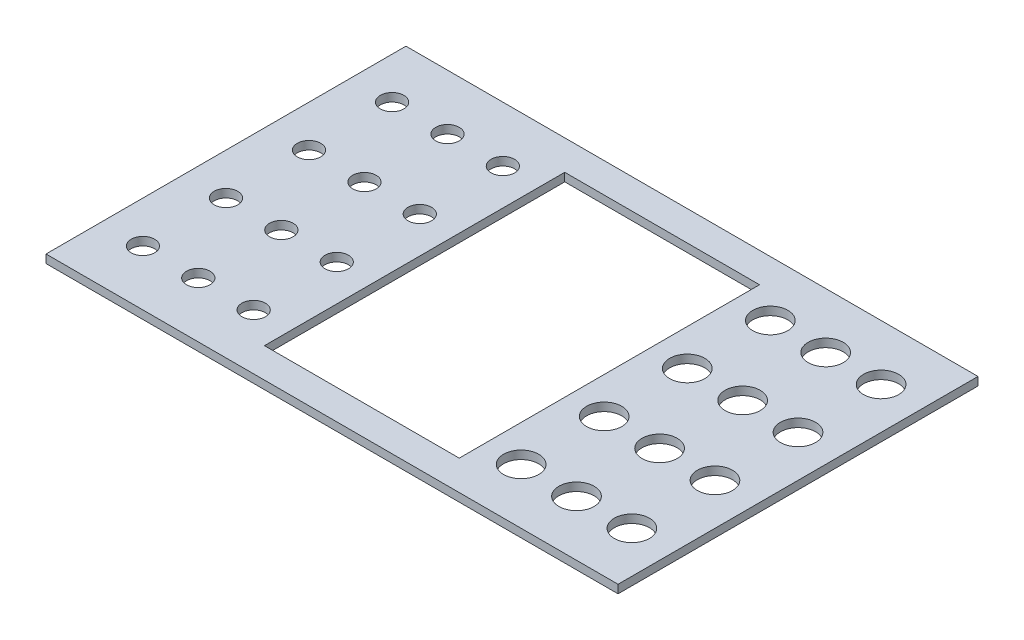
ISO-10303-21;
HEADER;
FILE_DESCRIPTION(('STEP AP214'),'2;1');
FILE_NAME('part.step','',(''),(''),'','','');
FILE_SCHEMA(('AUTOMOTIVE_DESIGN { 1 0 10303 214 1 1 1 1 }'));
ENDSEC;
DATA;
#1=APPLICATION_CONTEXT('core data for automotive mechanical design processes');
#2=APPLICATION_PROTOCOL_DEFINITION('international standard','automotive_design',2000,#1);
#3=PRODUCT_CONTEXT('',#1,'mechanical');
#4=PRODUCT('Part','Part','',(#3));
#5=PRODUCT_RELATED_PRODUCT_CATEGORY('part','',(#4));
#6=PRODUCT_DEFINITION_FORMATION('','',#4);
#7=PRODUCT_DEFINITION_CONTEXT('part definition',#1,'design');
#8=PRODUCT_DEFINITION('design','',#6,#7);
#9=PRODUCT_DEFINITION_SHAPE('','',#8);
#10=(LENGTH_UNIT() NAMED_UNIT(*) SI_UNIT(.MILLI.,.METRE.));
#11=(NAMED_UNIT(*) PLANE_ANGLE_UNIT() SI_UNIT($,.RADIAN.));
#12=(NAMED_UNIT(*) SI_UNIT($,.STERADIAN.) SOLID_ANGLE_UNIT());
#13=UNCERTAINTY_MEASURE_WITH_UNIT(LENGTH_MEASURE(1.E-05),#10,'distance_accuracy_value','');
#14=(GEOMETRIC_REPRESENTATION_CONTEXT(3) GLOBAL_UNCERTAINTY_ASSIGNED_CONTEXT((#13)) GLOBAL_UNIT_ASSIGNED_CONTEXT((#10,
#11,#12)) REPRESENTATION_CONTEXT('',''));
#15=CARTESIAN_POINT('',(0.,0.,0.));
#16=DIRECTION('',(0.,0.,1.));
#17=DIRECTION('',(1.,0.,0.));
#18=AXIS2_PLACEMENT_3D('',#15,#16,#17);
#19=CARTESIAN_POINT('',(206.6,6.,130.));
#20=DIRECTION('',(-1.,0.,0.));
#21=DIRECTION('',(0.,0.,1.));
#22=AXIS2_PLACEMENT_3D('',#19,#20,#21);
#23=PLANE('',#22);
#24=DIRECTION('',(0.,0.,-1.));
#25=VECTOR('',#24,1.);
#26=CARTESIAN_POINT('',(206.6,0.,130.));
#27=LINE('',#26,#25);
#28=CARTESIAN_POINT('',(206.6,0.,130.));
#29=VERTEX_POINT('',#28);
#30=CARTESIAN_POINT('',(206.6,0.,-130.));
#31=VERTEX_POINT('',#30);
#32=EDGE_CURVE('E223',#29,#31,#27,.T.);
#33=ORIENTED_EDGE('',*,*,#32,.T.);
#34=DIRECTION('',(0.,-1.,0.));
#35=VECTOR('',#34,1.);
#36=CARTESIAN_POINT('',(206.6,6.,-130.));
#37=LINE('',#36,#35);
#38=CARTESIAN_POINT('',(206.6,6.,-130.));
#39=VERTEX_POINT('',#38);
#40=EDGE_CURVE('E240',#39,#31,#37,.T.);
#41=ORIENTED_EDGE('',*,*,#40,.F.);
#42=DIRECTION('',(0.,0.,-1.));
#43=VECTOR('',#42,1.);
#44=CARTESIAN_POINT('',(206.6,6.,130.));
#45=LINE('',#44,#43);
#46=CARTESIAN_POINT('',(206.6,6.,130.));
#47=VERTEX_POINT('',#46);
#48=EDGE_CURVE('E212',#47,#39,#45,.T.);
#49=ORIENTED_EDGE('',*,*,#48,.F.);
#50=DIRECTION('',(0.,-1.,0.));
#51=VECTOR('',#50,1.);
#52=CARTESIAN_POINT('',(206.6,6.,130.));
#53=LINE('',#52,#51);
#54=EDGE_CURVE('E222',#47,#29,#53,.T.);
#55=ORIENTED_EDGE('',*,*,#54,.T.);
#56=EDGE_LOOP('',(#33,#41,#49,#55));
#57=FACE_BOUND('',#56,.T.);
#58=ADVANCED_FACE('F48',(#57),#23,.F.);
#59=CARTESIAN_POINT('',(-206.6,6.,-130.));
#60=DIRECTION('',(0.,0.,1.));
#61=DIRECTION('',(1.,0.,0.));
#62=AXIS2_PLACEMENT_3D('',#59,#60,#61);
#63=PLANE('',#62);
#64=DIRECTION('',(-1.,0.,0.));
#65=VECTOR('',#64,1.);
#66=CARTESIAN_POINT('',(-206.6,0.,-130.));
#67=LINE('',#66,#65);
#68=CARTESIAN_POINT('',(-206.6,0.,-130.));
#69=VERTEX_POINT('',#68);
#70=EDGE_CURVE('E226',#31,#69,#67,.T.);
#71=ORIENTED_EDGE('',*,*,#70,.T.);
#72=DIRECTION('',(0.,-1.,0.));
#73=VECTOR('',#72,1.);
#74=CARTESIAN_POINT('',(-206.6,6.,-130.));
#75=LINE('',#74,#73);
#76=CARTESIAN_POINT('',(-206.6,6.,-130.));
#77=VERTEX_POINT('',#76);
#78=EDGE_CURVE('E237',#77,#69,#75,.T.);
#79=ORIENTED_EDGE('',*,*,#78,.F.);
#80=DIRECTION('',(-1.,0.,0.));
#81=VECTOR('',#80,1.);
#82=CARTESIAN_POINT('',(-206.6,6.,-130.));
#83=LINE('',#82,#81);
#84=EDGE_CURVE('E215',#39,#77,#83,.T.);
#85=ORIENTED_EDGE('',*,*,#84,.F.);
#86=ORIENTED_EDGE('',*,*,#40,.T.);
#87=EDGE_LOOP('',(#71,#79,#85,#86));
#88=FACE_BOUND('',#87,.T.);
#89=ADVANCED_FACE('F338',(#88),#63,.F.);
#90=CARTESIAN_POINT('',(-206.6,6.,130.));
#91=DIRECTION('',(1.,0.,0.));
#92=DIRECTION('',(0.,0.,-1.));
#93=AXIS2_PLACEMENT_3D('',#90,#91,#92);
#94=PLANE('',#93);
#95=DIRECTION('',(0.,0.,1.));
#96=VECTOR('',#95,1.);
#97=CARTESIAN_POINT('',(-206.6,0.,130.));
#98=LINE('',#97,#96);
#99=CARTESIAN_POINT('',(-206.6,0.,130.));
#100=VERTEX_POINT('',#99);
#101=EDGE_CURVE('E229',#69,#100,#98,.T.);
#102=ORIENTED_EDGE('',*,*,#101,.T.);
#103=DIRECTION('',(0.,-1.,0.));
#104=VECTOR('',#103,1.);
#105=CARTESIAN_POINT('',(-206.6,6.,130.));
#106=LINE('',#105,#104);
#107=CARTESIAN_POINT('',(-206.6,6.,130.));
#108=VERTEX_POINT('',#107);
#109=EDGE_CURVE('E234',#108,#100,#106,.T.);
#110=ORIENTED_EDGE('',*,*,#109,.F.);
#111=DIRECTION('',(0.,0.,1.));
#112=VECTOR('',#111,1.);
#113=CARTESIAN_POINT('',(-206.6,6.,130.));
#114=LINE('',#113,#112);
#115=EDGE_CURVE('E218',#77,#108,#114,.T.);
#116=ORIENTED_EDGE('',*,*,#115,.F.);
#117=ORIENTED_EDGE('',*,*,#78,.T.);
#118=EDGE_LOOP('',(#102,#110,#116,#117));
#119=FACE_BOUND('',#118,.T.);
#120=ADVANCED_FACE('F343',(#119),#94,.F.);
#121=CARTESIAN_POINT('',(-206.6,6.,130.));
#122=DIRECTION('',(0.,0.,-1.));
#123=DIRECTION('',(-1.,0.,0.));
#124=AXIS2_PLACEMENT_3D('',#121,#122,#123);
#125=PLANE('',#124);
#126=DIRECTION('',(1.,0.,0.));
#127=VECTOR('',#126,1.);
#128=CARTESIAN_POINT('',(-206.6,0.,130.));
#129=LINE('',#128,#127);
#130=EDGE_CURVE('E216',#100,#29,#129,.T.);
#131=ORIENTED_EDGE('',*,*,#130,.T.);
#132=ORIENTED_EDGE('',*,*,#54,.F.);
#133=DIRECTION('',(1.,0.,0.));
#134=VECTOR('',#133,1.);
#135=CARTESIAN_POINT('',(-206.6,6.,130.));
#136=LINE('',#135,#134);
#137=EDGE_CURVE('E220',#108,#47,#136,.T.);
#138=ORIENTED_EDGE('',*,*,#137,.F.);
#139=ORIENTED_EDGE('',*,*,#109,.T.);
#140=EDGE_LOOP('',(#131,#132,#138,#139));
#141=FACE_BOUND('',#140,.T.);
#142=ADVANCED_FACE('F358',(#141),#125,.F.);
#143=CARTESIAN_POINT('',(0.,6.,0.));
#144=DIRECTION('',(0.,-1.,0.));
#145=DIRECTION('',(0.,0.,-1.));
#146=AXIS2_PLACEMENT_3D('',#143,#144,#145);
#147=PLANE('',#146);
#148=DIRECTION('',(-1.,0.,0.));
#149=VECTOR('',#148,1.);
#150=CARTESIAN_POINT('',(-70.35,6.,-108.45));
#151=LINE('',#150,#149);
#152=CARTESIAN_POINT('',(70.35,6.,-108.45));
#153=VERTEX_POINT('',#152);
#154=CARTESIAN_POINT('',(-70.35,6.,-108.45));
#155=VERTEX_POINT('',#154);
#156=EDGE_CURVE('E123',#153,#155,#151,.T.);
#157=ORIENTED_EDGE('',*,*,#156,.F.);
#158=DIRECTION('',(0.,0.,-1.));
#159=VECTOR('',#158,1.);
#160=CARTESIAN_POINT('',(70.35,6.,-108.45));
#161=LINE('',#160,#159);
#162=CARTESIAN_POINT('',(70.35,6.,108.45));
#163=VERTEX_POINT('',#162);
#164=EDGE_CURVE('E62',#163,#153,#161,.T.);
#165=ORIENTED_EDGE('',*,*,#164,.F.);
#166=DIRECTION('',(1.,0.,0.));
#167=VECTOR('',#166,1.);
#168=CARTESIAN_POINT('',(-70.35,6.,108.45));
#169=LINE('',#168,#167);
#170=CARTESIAN_POINT('',(-70.35,6.,108.45));
#171=VERTEX_POINT('',#170);
#172=EDGE_CURVE('E130',#171,#163,#169,.T.);
#173=ORIENTED_EDGE('',*,*,#172,.F.);
#174=DIRECTION('',(0.,0.,1.));
#175=VECTOR('',#174,1.);
#176=CARTESIAN_POINT('',(-70.35,6.,-108.45));
#177=LINE('',#176,#175);
#178=EDGE_CURVE('E114',#155,#171,#177,.T.);
#179=ORIENTED_EDGE('',*,*,#178,.F.);
#180=EDGE_LOOP('',(#157,#165,#173,#179));
#181=FACE_BOUND('',#180,.T.);
#182=CARTESIAN_POINT('',(176.6,6.,-90.));
#183=DIRECTION('',(0.,1.,0.));
#184=DIRECTION('',(0.,0.,1.));
#185=AXIS2_PLACEMENT_3D('',#182,#183,#184);
#186=CIRCLE('',#185,12.7);
#187=CARTESIAN_POINT('',(176.6,6.,-77.3));
#188=VERTEX_POINT('',#187);
#189=EDGE_CURVE('E164',#188,#188,#186,.T.);
#190=ORIENTED_EDGE('',*,*,#189,.F.);
#191=EDGE_LOOP('',(#190));
#192=FACE_BOUND('',#191,.T.);
#193=CARTESIAN_POINT('',(-176.6,6.,90.));
#194=DIRECTION('',(0.,1.,0.));
#195=DIRECTION('',(0.,0.,1.));
#196=AXIS2_PLACEMENT_3D('',#193,#194,#195);
#197=CIRCLE('',#196,8.50000000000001);
#198=CARTESIAN_POINT('',(-176.6,6.,98.5));
#199=VERTEX_POINT('',#198);
#200=EDGE_CURVE('E173',#199,#199,#197,.T.);
#201=ORIENTED_EDGE('',*,*,#200,.F.);
#202=EDGE_LOOP('',(#201));
#203=FACE_BOUND('',#202,.T.);
#204=CARTESIAN_POINT('',(-176.6,6.,30.));
#205=DIRECTION('',(0.,1.,0.));
#206=DIRECTION('',(0.,0.,1.));
#207=AXIS2_PLACEMENT_3D('',#204,#205,#206);
#208=CIRCLE('',#207,8.50000000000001);
#209=CARTESIAN_POINT('',(-176.6,6.,38.5));
#210=VERTEX_POINT('',#209);
#211=EDGE_CURVE('E176',#210,#210,#208,.T.);
#212=ORIENTED_EDGE('',*,*,#211,.F.);
#213=EDGE_LOOP('',(#212));
#214=FACE_BOUND('',#213,.T.);
#215=CARTESIAN_POINT('',(-176.6,6.,-30.));
#216=DIRECTION('',(0.,1.,0.));
#217=DIRECTION('',(0.,0.,1.));
#218=AXIS2_PLACEMENT_3D('',#215,#216,#217);
#219=CIRCLE('',#218,8.50000000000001);
#220=CARTESIAN_POINT('',(-176.6,6.,-21.5));
#221=VERTEX_POINT('',#220);
#222=EDGE_CURVE('E179',#221,#221,#219,.T.);
#223=ORIENTED_EDGE('',*,*,#222,.F.);
#224=EDGE_LOOP('',(#223));
#225=FACE_BOUND('',#224,.T.);
#226=CARTESIAN_POINT('',(136.6,6.,-89.9999999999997));
#227=DIRECTION('',(0.,1.,0.));
#228=DIRECTION('',(0.,0.,1.));
#229=AXIS2_PLACEMENT_3D('',#226,#227,#228);
#230=CIRCLE('',#229,12.7);
#231=CARTESIAN_POINT('',(136.6,6.,-77.2999999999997));
#232=VERTEX_POINT('',#231);
#233=EDGE_CURVE('E161',#232,#232,#230,.T.);
#234=ORIENTED_EDGE('',*,*,#233,.F.);
#235=EDGE_LOOP('',(#234));
#236=FACE_BOUND('',#235,.T.);
#237=CARTESIAN_POINT('',(136.600000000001,6.,-29.9999999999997));
#238=DIRECTION('',(0.,1.,0.));
#239=DIRECTION('',(0.,0.,1.));
#240=AXIS2_PLACEMENT_3D('',#237,#238,#239);
#241=CIRCLE('',#240,12.7);
#242=CARTESIAN_POINT('',(136.600000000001,6.,-17.2999999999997));
#243=VERTEX_POINT('',#242);
#244=EDGE_CURVE('E165',#243,#243,#241,.T.);
#245=ORIENTED_EDGE('',*,*,#244,.F.);
#246=EDGE_LOOP('',(#245));
#247=FACE_BOUND('',#246,.T.);
#248=CARTESIAN_POINT('',(136.600000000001,6.,30.0000000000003));
#249=DIRECTION('',(0.,1.,0.));
#250=DIRECTION('',(0.,0.,1.));
#251=AXIS2_PLACEMENT_3D('',#248,#249,#250);
#252=CIRCLE('',#251,12.7);
#253=CARTESIAN_POINT('',(136.600000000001,6.,42.7000000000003));
#254=VERTEX_POINT('',#253);
#255=EDGE_CURVE('E168',#254,#254,#252,.T.);
#256=ORIENTED_EDGE('',*,*,#255,.F.);
#257=EDGE_LOOP('',(#256));
#258=FACE_BOUND('',#257,.T.);
#259=CARTESIAN_POINT('',(136.600000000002,6.,90.0000000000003));
#260=DIRECTION('',(0.,1.,0.));
#261=DIRECTION('',(0.,0.,1.));
#262=AXIS2_PLACEMENT_3D('',#259,#260,#261);
#263=CIRCLE('',#262,12.7);
#264=CARTESIAN_POINT('',(136.600000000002,6.,102.7));
#265=VERTEX_POINT('',#264);
#266=EDGE_CURVE('E158',#265,#265,#263,.T.);
#267=ORIENTED_EDGE('',*,*,#266,.F.);
#268=EDGE_LOOP('',(#267));
#269=FACE_BOUND('',#268,.T.);
#270=CARTESIAN_POINT('',(-96.6000000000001,6.,90.));
#271=DIRECTION('',(0.,1.,0.));
#272=DIRECTION('',(0.,0.,1.));
#273=AXIS2_PLACEMENT_3D('',#270,#271,#272);
#274=CIRCLE('',#273,8.50000000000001);
#275=CARTESIAN_POINT('',(-96.6000000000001,6.,98.5));
#276=VERTEX_POINT('',#275);
#277=EDGE_CURVE('E182',#276,#276,#274,.T.);
#278=ORIENTED_EDGE('',*,*,#277,.F.);
#279=EDGE_LOOP('',(#278));
#280=FACE_BOUND('',#279,.T.);
#281=CARTESIAN_POINT('',(-136.6,6.,90.));
#282=DIRECTION('',(0.,1.,0.));
#283=DIRECTION('',(0.,0.,1.));
#284=AXIS2_PLACEMENT_3D('',#281,#282,#283);
#285=CIRCLE('',#284,8.50000000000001);
#286=CARTESIAN_POINT('',(-136.6,6.,98.5));
#287=VERTEX_POINT('',#286);
#288=EDGE_CURVE('E204',#287,#287,#285,.T.);
#289=ORIENTED_EDGE('',*,*,#288,.F.);
#290=EDGE_LOOP('',(#289));
#291=FACE_BOUND('',#290,.T.);
#292=CARTESIAN_POINT('',(-96.6000000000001,6.,30.));
#293=DIRECTION('',(0.,1.,0.));
#294=DIRECTION('',(0.,0.,1.));
#295=AXIS2_PLACEMENT_3D('',#292,#293,#294);
#296=CIRCLE('',#295,8.5);
#297=CARTESIAN_POINT('',(-96.6000000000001,6.,38.5));
#298=VERTEX_POINT('',#297);
#299=EDGE_CURVE('E201',#298,#298,#296,.T.);
#300=ORIENTED_EDGE('',*,*,#299,.F.);
#301=EDGE_LOOP('',(#300));
#302=FACE_BOUND('',#301,.T.);
#303=CARTESIAN_POINT('',(-136.6,6.,30.));
#304=DIRECTION('',(0.,1.,0.));
#305=DIRECTION('',(0.,0.,1.));
#306=AXIS2_PLACEMENT_3D('',#303,#304,#305);
#307=CIRCLE('',#306,8.50000000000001);
#308=CARTESIAN_POINT('',(-136.6,6.,38.5));
#309=VERTEX_POINT('',#308);
#310=EDGE_CURVE('E198',#309,#309,#307,.T.);
#311=ORIENTED_EDGE('',*,*,#310,.F.);
#312=EDGE_LOOP('',(#311));
#313=FACE_BOUND('',#312,.T.);
#314=CARTESIAN_POINT('',(-96.6000000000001,6.,-30.));
#315=DIRECTION('',(0.,1.,0.));
#316=DIRECTION('',(0.,0.,1.));
#317=AXIS2_PLACEMENT_3D('',#314,#315,#316);
#318=CIRCLE('',#317,8.5);
#319=CARTESIAN_POINT('',(-96.6000000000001,6.,-21.5));
#320=VERTEX_POINT('',#319);
#321=EDGE_CURVE('E195',#320,#320,#318,.T.);
#322=ORIENTED_EDGE('',*,*,#321,.F.);
#323=EDGE_LOOP('',(#322));
#324=FACE_BOUND('',#323,.T.);
#325=CARTESIAN_POINT('',(-136.6,6.,-30.));
#326=DIRECTION('',(0.,1.,0.));
#327=DIRECTION('',(0.,0.,1.));
#328=AXIS2_PLACEMENT_3D('',#325,#326,#327);
#329=CIRCLE('',#328,8.50000000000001);
#330=CARTESIAN_POINT('',(-136.6,6.,-21.5));
#331=VERTEX_POINT('',#330);
#332=EDGE_CURVE('E192',#331,#331,#329,.T.);
#333=ORIENTED_EDGE('',*,*,#332,.F.);
#334=EDGE_LOOP('',(#333));
#335=FACE_BOUND('',#334,.T.);
#336=CARTESIAN_POINT('',(-96.6000000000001,6.,-90.));
#337=DIRECTION('',(0.,1.,0.));
#338=DIRECTION('',(0.,0.,1.));
#339=AXIS2_PLACEMENT_3D('',#336,#337,#338);
#340=CIRCLE('',#339,8.50000000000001);
#341=CARTESIAN_POINT('',(-96.6000000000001,6.,-81.5));
#342=VERTEX_POINT('',#341);
#343=EDGE_CURVE('E189',#342,#342,#340,.T.);
#344=ORIENTED_EDGE('',*,*,#343,.F.);
#345=EDGE_LOOP('',(#344));
#346=FACE_BOUND('',#345,.T.);
#347=CARTESIAN_POINT('',(-136.6,6.,-90.));
#348=DIRECTION('',(0.,1.,0.));
#349=DIRECTION('',(0.,0.,1.));
#350=AXIS2_PLACEMENT_3D('',#347,#348,#349);
#351=CIRCLE('',#350,8.50000000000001);
#352=CARTESIAN_POINT('',(-136.6,6.,-81.5));
#353=VERTEX_POINT('',#352);
#354=EDGE_CURVE('E185',#353,#353,#351,.T.);
#355=ORIENTED_EDGE('',*,*,#354,.F.);
#356=EDGE_LOOP('',(#355));
#357=FACE_BOUND('',#356,.T.);
#358=CARTESIAN_POINT('',(96.6000000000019,6.,90.0000000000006));
#359=DIRECTION('',(0.,1.,0.));
#360=DIRECTION('',(0.,0.,1.));
#361=AXIS2_PLACEMENT_3D('',#358,#359,#360);
#362=CIRCLE('',#361,12.7);
#363=CARTESIAN_POINT('',(96.6000000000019,6.,102.700000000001));
#364=VERTEX_POINT('',#363);
#365=EDGE_CURVE('E137',#364,#364,#362,.T.);
#366=ORIENTED_EDGE('',*,*,#365,.F.);
#367=EDGE_LOOP('',(#366));
#368=FACE_BOUND('',#367,.T.);
#369=CARTESIAN_POINT('',(96.6000000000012,6.,30.0000000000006));
#370=DIRECTION('',(0.,1.,0.));
#371=DIRECTION('',(0.,0.,1.));
#372=AXIS2_PLACEMENT_3D('',#369,#370,#371);
#373=CIRCLE('',#372,12.7);
#374=CARTESIAN_POINT('',(96.6000000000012,6.,42.7000000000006));
#375=VERTEX_POINT('',#374);
#376=EDGE_CURVE('E144',#375,#375,#373,.T.);
#377=ORIENTED_EDGE('',*,*,#376,.F.);
#378=EDGE_LOOP('',(#377));
#379=FACE_BOUND('',#378,.T.);
#380=CARTESIAN_POINT('',(96.6000000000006,6.,-29.9999999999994));
#381=DIRECTION('',(0.,1.,0.));
#382=DIRECTION('',(0.,0.,1.));
#383=AXIS2_PLACEMENT_3D('',#380,#381,#382);
#384=CIRCLE('',#383,12.7);
#385=CARTESIAN_POINT('',(96.6000000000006,6.,-17.2999999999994));
#386=VERTEX_POINT('',#385);
#387=EDGE_CURVE('E140',#386,#386,#384,.T.);
#388=ORIENTED_EDGE('',*,*,#387,.F.);
#389=EDGE_LOOP('',(#388));
#390=FACE_BOUND('',#389,.T.);
#391=CARTESIAN_POINT('',(176.600000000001,6.,-30.));
#392=DIRECTION('',(0.,1.,0.));
#393=DIRECTION('',(0.,0.,1.));
#394=AXIS2_PLACEMENT_3D('',#391,#392,#393);
#395=CIRCLE('',#394,12.7);
#396=CARTESIAN_POINT('',(176.600000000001,6.,-17.3));
#397=VERTEX_POINT('',#396);
#398=EDGE_CURVE('E155',#397,#397,#395,.T.);
#399=ORIENTED_EDGE('',*,*,#398,.F.);
#400=EDGE_LOOP('',(#399));
#401=FACE_BOUND('',#400,.T.);
#402=CARTESIAN_POINT('',(176.600000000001,6.,30.));
#403=DIRECTION('',(0.,1.,0.));
#404=DIRECTION('',(0.,0.,1.));
#405=AXIS2_PLACEMENT_3D('',#402,#403,#404);
#406=CIRCLE('',#405,12.7);
#407=CARTESIAN_POINT('',(176.600000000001,6.,42.7));
#408=VERTEX_POINT('',#407);
#409=EDGE_CURVE('E152',#408,#408,#406,.T.);
#410=ORIENTED_EDGE('',*,*,#409,.F.);
#411=EDGE_LOOP('',(#410));
#412=FACE_BOUND('',#411,.T.);
#413=CARTESIAN_POINT('',(176.6,6.,90.));
#414=DIRECTION('',(0.,1.,0.));
#415=DIRECTION('',(0.,0.,1.));
#416=AXIS2_PLACEMENT_3D('',#413,#414,#415);
#417=CIRCLE('',#416,12.7);
#418=CARTESIAN_POINT('',(176.6,6.,102.7));
#419=VERTEX_POINT('',#418);
#420=EDGE_CURVE('E149',#419,#419,#417,.T.);
#421=ORIENTED_EDGE('',*,*,#420,.F.);
#422=EDGE_LOOP('',(#421));
#423=FACE_BOUND('',#422,.T.);
#424=CARTESIAN_POINT('',(96.6,6.,-89.9999999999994));
#425=DIRECTION('',(0.,1.,0.));
#426=DIRECTION('',(0.,0.,1.));
#427=AXIS2_PLACEMENT_3D('',#424,#425,#426);
#428=CIRCLE('',#427,12.7);
#429=CARTESIAN_POINT('',(96.6,6.,-77.2999999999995));
#430=VERTEX_POINT('',#429);
#431=EDGE_CURVE('E143',#430,#430,#428,.T.);
#432=ORIENTED_EDGE('',*,*,#431,.F.);
#433=EDGE_LOOP('',(#432));
#434=FACE_BOUND('',#433,.T.);
#435=CARTESIAN_POINT('',(-176.6,6.,-90.));
#436=DIRECTION('',(0.,1.,0.));
#437=DIRECTION('',(0.,0.,1.));
#438=AXIS2_PLACEMENT_3D('',#435,#436,#437);
#439=CIRCLE('',#438,8.50000000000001);
#440=CARTESIAN_POINT('',(-176.6,6.,-81.5));
#441=VERTEX_POINT('',#440);
#442=EDGE_CURVE('E188',#441,#441,#439,.T.);
#443=ORIENTED_EDGE('',*,*,#442,.F.);
#444=EDGE_LOOP('',(#443));
#445=FACE_BOUND('',#444,.T.);
#446=ORIENTED_EDGE('',*,*,#48,.T.);
#447=ORIENTED_EDGE('',*,*,#84,.T.);
#448=ORIENTED_EDGE('',*,*,#115,.T.);
#449=ORIENTED_EDGE('',*,*,#137,.T.);
#450=EDGE_LOOP('',(#446,#447,#448,#449));
#451=FACE_BOUND('',#450,.T.);
#452=ADVANCED_FACE('F127',(#181,#192,#203,#214,#225,#236,#247,#258,#269,#280,#291,#302,#313,
#324,#335,#346,#357,#368,#379,#390,#401,#412,#423,#434,#445,#451),#147,.F.);
#453=CARTESIAN_POINT('',(0.,0.,0.));
#454=DIRECTION('',(0.,-1.,0.));
#455=DIRECTION('',(0.,0.,-1.));
#456=AXIS2_PLACEMENT_3D('',#453,#454,#455);
#457=PLANE('',#456);
#458=DIRECTION('',(0.,0.,1.));
#459=VECTOR('',#458,1.);
#460=CARTESIAN_POINT('',(70.35,0.,0.));
#461=LINE('',#460,#459);
#462=CARTESIAN_POINT('',(70.35,0.,-108.45));
#463=VERTEX_POINT('',#462);
#464=CARTESIAN_POINT('',(70.35,0.,108.45));
#465=VERTEX_POINT('',#464);
#466=EDGE_CURVE('E13',#463,#465,#461,.T.);
#467=ORIENTED_EDGE('',*,*,#466,.F.);
#468=DIRECTION('',(1.,0.,0.));
#469=VECTOR('',#468,1.);
#470=CARTESIAN_POINT('',(0.,0.,-108.45));
#471=LINE('',#470,#469);
#472=CARTESIAN_POINT('',(-70.35,0.,-108.45));
#473=VERTEX_POINT('',#472);
#474=EDGE_CURVE('E243',#473,#463,#471,.T.);
#475=ORIENTED_EDGE('',*,*,#474,.F.);
#476=DIRECTION('',(0.,0.,-1.));
#477=VECTOR('',#476,1.);
#478=CARTESIAN_POINT('',(-70.35,0.,0.));
#479=LINE('',#478,#477);
#480=CARTESIAN_POINT('',(-70.35,0.,108.45));
#481=VERTEX_POINT('',#480);
#482=EDGE_CURVE('E117',#481,#473,#479,.T.);
#483=ORIENTED_EDGE('',*,*,#482,.F.);
#484=DIRECTION('',(-1.,0.,0.));
#485=VECTOR('',#484,1.);
#486=CARTESIAN_POINT('',(0.,0.,108.45));
#487=LINE('',#486,#485);
#488=EDGE_CURVE('E55',#465,#481,#487,.T.);
#489=ORIENTED_EDGE('',*,*,#488,.F.);
#490=EDGE_LOOP('',(#467,#475,#483,#489));
#491=FACE_BOUND('',#490,.T.);
#492=CARTESIAN_POINT('',(176.6,0.,-90.));
#493=DIRECTION('',(0.,-1.,0.));
#494=DIRECTION('',(0.,0.,-1.));
#495=AXIS2_PLACEMENT_3D('',#492,#493,#494);
#496=CIRCLE('',#495,12.7);
#497=CARTESIAN_POINT('',(176.6,0.,-102.7));
#498=VERTEX_POINT('',#497);
#499=EDGE_CURVE('E227',#498,#498,#496,.T.);
#500=ORIENTED_EDGE('',*,*,#499,.F.);
#501=EDGE_LOOP('',(#500));
#502=FACE_BOUND('',#501,.T.);
#503=CARTESIAN_POINT('',(-176.6,0.,90.));
#504=DIRECTION('',(0.,-1.,0.));
#505=DIRECTION('',(0.,0.,-1.));
#506=AXIS2_PLACEMENT_3D('',#503,#504,#505);
#507=CIRCLE('',#506,8.50000000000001);
#508=CARTESIAN_POINT('',(-176.6,0.,81.5));
#509=VERTEX_POINT('',#508);
#510=EDGE_CURVE('E309',#509,#509,#507,.T.);
#511=ORIENTED_EDGE('',*,*,#510,.F.);
#512=EDGE_LOOP('',(#511));
#513=FACE_BOUND('',#512,.T.);
#514=CARTESIAN_POINT('',(-176.6,0.,30.));
#515=DIRECTION('',(0.,-1.,0.));
#516=DIRECTION('',(0.,0.,-1.));
#517=AXIS2_PLACEMENT_3D('',#514,#515,#516);
#518=CIRCLE('',#517,8.50000000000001);
#519=CARTESIAN_POINT('',(-176.6,0.,21.5));
#520=VERTEX_POINT('',#519);
#521=EDGE_CURVE('E306',#520,#520,#518,.T.);
#522=ORIENTED_EDGE('',*,*,#521,.F.);
#523=EDGE_LOOP('',(#522));
#524=FACE_BOUND('',#523,.T.);
#525=CARTESIAN_POINT('',(-176.6,0.,-30.));
#526=DIRECTION('',(0.,-1.,0.));
#527=DIRECTION('',(0.,0.,-1.));
#528=AXIS2_PLACEMENT_3D('',#525,#526,#527);
#529=CIRCLE('',#528,8.50000000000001);
#530=CARTESIAN_POINT('',(-176.6,0.,-38.5));
#531=VERTEX_POINT('',#530);
#532=EDGE_CURVE('E303',#531,#531,#529,.T.);
#533=ORIENTED_EDGE('',*,*,#532,.F.);
#534=EDGE_LOOP('',(#533));
#535=FACE_BOUND('',#534,.T.);
#536=CARTESIAN_POINT('',(136.6,0.,-89.9999999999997));
#537=DIRECTION('',(0.,-1.,0.));
#538=DIRECTION('',(0.,0.,-1.));
#539=AXIS2_PLACEMENT_3D('',#536,#537,#538);
#540=CIRCLE('',#539,12.7);
#541=CARTESIAN_POINT('',(136.6,0.,-102.7));
#542=VERTEX_POINT('',#541);
#543=EDGE_CURVE('E300',#542,#542,#540,.T.);
#544=ORIENTED_EDGE('',*,*,#543,.F.);
#545=EDGE_LOOP('',(#544));
#546=FACE_BOUND('',#545,.T.);
#547=CARTESIAN_POINT('',(136.600000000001,0.,-29.9999999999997));
#548=DIRECTION('',(0.,-1.,0.));
#549=DIRECTION('',(0.,0.,-1.));
#550=AXIS2_PLACEMENT_3D('',#547,#548,#549);
#551=CIRCLE('',#550,12.7);
#552=CARTESIAN_POINT('',(136.600000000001,0.,-42.6999999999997));
#553=VERTEX_POINT('',#552);
#554=EDGE_CURVE('E297',#553,#553,#551,.T.);
#555=ORIENTED_EDGE('',*,*,#554,.F.);
#556=EDGE_LOOP('',(#555));
#557=FACE_BOUND('',#556,.T.);
#558=CARTESIAN_POINT('',(136.600000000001,0.,30.0000000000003));
#559=DIRECTION('',(0.,-1.,0.));
#560=DIRECTION('',(0.,0.,-1.));
#561=AXIS2_PLACEMENT_3D('',#558,#559,#560);
#562=CIRCLE('',#561,12.7);
#563=CARTESIAN_POINT('',(136.600000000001,0.,17.3000000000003));
#564=VERTEX_POINT('',#563);
#565=EDGE_CURVE('E294',#564,#564,#562,.T.);
#566=ORIENTED_EDGE('',*,*,#565,.F.);
#567=EDGE_LOOP('',(#566));
#568=FACE_BOUND('',#567,.T.);
#569=CARTESIAN_POINT('',(136.600000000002,0.,90.0000000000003));
#570=DIRECTION('',(0.,-1.,0.));
#571=DIRECTION('',(0.,0.,-1.));
#572=AXIS2_PLACEMENT_3D('',#569,#570,#571);
#573=CIRCLE('',#572,12.7);
#574=CARTESIAN_POINT('',(136.600000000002,0.,77.3000000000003));
#575=VERTEX_POINT('',#574);
#576=EDGE_CURVE('E291',#575,#575,#573,.T.);
#577=ORIENTED_EDGE('',*,*,#576,.F.);
#578=EDGE_LOOP('',(#577));
#579=FACE_BOUND('',#578,.T.);
#580=CARTESIAN_POINT('',(-96.6000000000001,0.,90.));
#581=DIRECTION('',(0.,-1.,0.));
#582=DIRECTION('',(0.,0.,-1.));
#583=AXIS2_PLACEMENT_3D('',#580,#581,#582);
#584=CIRCLE('',#583,8.50000000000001);
#585=CARTESIAN_POINT('',(-96.6000000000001,0.,81.5));
#586=VERTEX_POINT('',#585);
#587=EDGE_CURVE('E288',#586,#586,#584,.T.);
#588=ORIENTED_EDGE('',*,*,#587,.F.);
#589=EDGE_LOOP('',(#588));
#590=FACE_BOUND('',#589,.T.);
#591=CARTESIAN_POINT('',(-136.6,0.,90.));
#592=DIRECTION('',(0.,-1.,0.));
#593=DIRECTION('',(0.,0.,-1.));
#594=AXIS2_PLACEMENT_3D('',#591,#592,#593);
#595=CIRCLE('',#594,8.50000000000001);
#596=CARTESIAN_POINT('',(-136.6,0.,81.5));
#597=VERTEX_POINT('',#596);
#598=EDGE_CURVE('E285',#597,#597,#595,.T.);
#599=ORIENTED_EDGE('',*,*,#598,.F.);
#600=EDGE_LOOP('',(#599));
#601=FACE_BOUND('',#600,.T.);
#602=CARTESIAN_POINT('',(-96.6000000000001,0.,30.));
#603=DIRECTION('',(0.,-1.,0.));
#604=DIRECTION('',(0.,0.,-1.));
#605=AXIS2_PLACEMENT_3D('',#602,#603,#604);
#606=CIRCLE('',#605,8.5);
#607=CARTESIAN_POINT('',(-96.6000000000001,0.,21.5));
#608=VERTEX_POINT('',#607);
#609=EDGE_CURVE('E282',#608,#608,#606,.T.);
#610=ORIENTED_EDGE('',*,*,#609,.F.);
#611=EDGE_LOOP('',(#610));
#612=FACE_BOUND('',#611,.T.);
#613=CARTESIAN_POINT('',(-136.6,0.,30.));
#614=DIRECTION('',(0.,-1.,0.));
#615=DIRECTION('',(0.,0.,-1.));
#616=AXIS2_PLACEMENT_3D('',#613,#614,#615);
#617=CIRCLE('',#616,8.50000000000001);
#618=CARTESIAN_POINT('',(-136.6,0.,21.5));
#619=VERTEX_POINT('',#618);
#620=EDGE_CURVE('E279',#619,#619,#617,.T.);
#621=ORIENTED_EDGE('',*,*,#620,.F.);
#622=EDGE_LOOP('',(#621));
#623=FACE_BOUND('',#622,.T.);
#624=CARTESIAN_POINT('',(-96.6000000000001,0.,-30.));
#625=DIRECTION('',(0.,-1.,0.));
#626=DIRECTION('',(0.,0.,-1.));
#627=AXIS2_PLACEMENT_3D('',#624,#625,#626);
#628=CIRCLE('',#627,8.5);
#629=CARTESIAN_POINT('',(-96.6000000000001,0.,-38.5));
#630=VERTEX_POINT('',#629);
#631=EDGE_CURVE('E276',#630,#630,#628,.T.);
#632=ORIENTED_EDGE('',*,*,#631,.F.);
#633=EDGE_LOOP('',(#632));
#634=FACE_BOUND('',#633,.T.);
#635=CARTESIAN_POINT('',(-136.6,0.,-30.));
#636=DIRECTION('',(0.,-1.,0.));
#637=DIRECTION('',(0.,0.,-1.));
#638=AXIS2_PLACEMENT_3D('',#635,#636,#637);
#639=CIRCLE('',#638,8.50000000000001);
#640=CARTESIAN_POINT('',(-136.6,0.,-38.5));
#641=VERTEX_POINT('',#640);
#642=EDGE_CURVE('E273',#641,#641,#639,.T.);
#643=ORIENTED_EDGE('',*,*,#642,.F.);
#644=EDGE_LOOP('',(#643));
#645=FACE_BOUND('',#644,.T.);
#646=CARTESIAN_POINT('',(-96.6000000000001,0.,-90.));
#647=DIRECTION('',(0.,-1.,0.));
#648=DIRECTION('',(0.,0.,-1.));
#649=AXIS2_PLACEMENT_3D('',#646,#647,#648);
#650=CIRCLE('',#649,8.50000000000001);
#651=CARTESIAN_POINT('',(-96.6000000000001,0.,-98.5));
#652=VERTEX_POINT('',#651);
#653=EDGE_CURVE('E270',#652,#652,#650,.T.);
#654=ORIENTED_EDGE('',*,*,#653,.F.);
#655=EDGE_LOOP('',(#654));
#656=FACE_BOUND('',#655,.T.);
#657=CARTESIAN_POINT('',(-136.6,0.,-90.));
#658=DIRECTION('',(0.,-1.,0.));
#659=DIRECTION('',(0.,0.,-1.));
#660=AXIS2_PLACEMENT_3D('',#657,#658,#659);
#661=CIRCLE('',#660,8.50000000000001);
#662=CARTESIAN_POINT('',(-136.6,0.,-98.5));
#663=VERTEX_POINT('',#662);
#664=EDGE_CURVE('E267',#663,#663,#661,.T.);
#665=ORIENTED_EDGE('',*,*,#664,.F.);
#666=EDGE_LOOP('',(#665));
#667=FACE_BOUND('',#666,.T.);
#668=CARTESIAN_POINT('',(96.6000000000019,0.,90.0000000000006));
#669=DIRECTION('',(0.,-1.,0.));
#670=DIRECTION('',(0.,0.,-1.));
#671=AXIS2_PLACEMENT_3D('',#668,#669,#670);
#672=CIRCLE('',#671,12.7);
#673=CARTESIAN_POINT('',(96.6000000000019,0.,77.3000000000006));
#674=VERTEX_POINT('',#673);
#675=EDGE_CURVE('E264',#674,#674,#672,.T.);
#676=ORIENTED_EDGE('',*,*,#675,.F.);
#677=EDGE_LOOP('',(#676));
#678=FACE_BOUND('',#677,.T.);
#679=CARTESIAN_POINT('',(96.6000000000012,0.,30.0000000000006));
#680=DIRECTION('',(0.,-1.,0.));
#681=DIRECTION('',(0.,0.,-1.));
#682=AXIS2_PLACEMENT_3D('',#679,#680,#681);
#683=CIRCLE('',#682,12.7);
#684=CARTESIAN_POINT('',(96.6000000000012,0.,17.3000000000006));
#685=VERTEX_POINT('',#684);
#686=EDGE_CURVE('E261',#685,#685,#683,.T.);
#687=ORIENTED_EDGE('',*,*,#686,.F.);
#688=EDGE_LOOP('',(#687));
#689=FACE_BOUND('',#688,.T.);
#690=CARTESIAN_POINT('',(96.6000000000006,0.,-29.9999999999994));
#691=DIRECTION('',(0.,-1.,0.));
#692=DIRECTION('',(0.,0.,-1.));
#693=AXIS2_PLACEMENT_3D('',#690,#691,#692);
#694=CIRCLE('',#693,12.7);
#695=CARTESIAN_POINT('',(96.6000000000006,0.,-42.6999999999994));
#696=VERTEX_POINT('',#695);
#697=EDGE_CURVE('E258',#696,#696,#694,.T.);
#698=ORIENTED_EDGE('',*,*,#697,.F.);
#699=EDGE_LOOP('',(#698));
#700=FACE_BOUND('',#699,.T.);
#701=CARTESIAN_POINT('',(176.600000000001,0.,-30.));
#702=DIRECTION('',(0.,-1.,0.));
#703=DIRECTION('',(0.,0.,-1.));
#704=AXIS2_PLACEMENT_3D('',#701,#702,#703);
#705=CIRCLE('',#704,12.7);
#706=CARTESIAN_POINT('',(176.600000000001,0.,-42.7));
#707=VERTEX_POINT('',#706);
#708=EDGE_CURVE('E255',#707,#707,#705,.T.);
#709=ORIENTED_EDGE('',*,*,#708,.F.);
#710=EDGE_LOOP('',(#709));
#711=FACE_BOUND('',#710,.T.);
#712=CARTESIAN_POINT('',(176.600000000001,0.,30.));
#713=DIRECTION('',(0.,-1.,0.));
#714=DIRECTION('',(0.,0.,-1.));
#715=AXIS2_PLACEMENT_3D('',#712,#713,#714);
#716=CIRCLE('',#715,12.7);
#717=CARTESIAN_POINT('',(176.600000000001,0.,17.3));
#718=VERTEX_POINT('',#717);
#719=EDGE_CURVE('E252',#718,#718,#716,.T.);
#720=ORIENTED_EDGE('',*,*,#719,.F.);
#721=EDGE_LOOP('',(#720));
#722=FACE_BOUND('',#721,.T.);
#723=CARTESIAN_POINT('',(176.6,0.,90.));
#724=DIRECTION('',(0.,-1.,0.));
#725=DIRECTION('',(0.,0.,-1.));
#726=AXIS2_PLACEMENT_3D('',#723,#724,#725);
#727=CIRCLE('',#726,12.7);
#728=CARTESIAN_POINT('',(176.6,0.,77.3));
#729=VERTEX_POINT('',#728);
#730=EDGE_CURVE('E249',#729,#729,#727,.T.);
#731=ORIENTED_EDGE('',*,*,#730,.F.);
#732=EDGE_LOOP('',(#731));
#733=FACE_BOUND('',#732,.T.);
#734=CARTESIAN_POINT('',(96.6,0.,-89.9999999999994));
#735=DIRECTION('',(0.,-1.,0.));
#736=DIRECTION('',(0.,0.,-1.));
#737=AXIS2_PLACEMENT_3D('',#734,#735,#736);
#738=CIRCLE('',#737,12.7);
#739=CARTESIAN_POINT('',(96.6,0.,-102.699999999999));
#740=VERTEX_POINT('',#739);
#741=EDGE_CURVE('E246',#740,#740,#738,.T.);
#742=ORIENTED_EDGE('',*,*,#741,.F.);
#743=EDGE_LOOP('',(#742));
#744=FACE_BOUND('',#743,.T.);
#745=CARTESIAN_POINT('',(-176.6,0.,-90.));
#746=DIRECTION('',(0.,-1.,0.));
#747=DIRECTION('',(0.,0.,-1.));
#748=AXIS2_PLACEMENT_3D('',#745,#746,#747);
#749=CIRCLE('',#748,8.50000000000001);
#750=CARTESIAN_POINT('',(-176.6,0.,-98.5));
#751=VERTEX_POINT('',#750);
#752=EDGE_CURVE('E211',#751,#751,#749,.T.);
#753=ORIENTED_EDGE('',*,*,#752,.F.);
#754=EDGE_LOOP('',(#753));
#755=FACE_BOUND('',#754,.T.);
#756=ORIENTED_EDGE('',*,*,#32,.F.);
#757=ORIENTED_EDGE('',*,*,#130,.F.);
#758=ORIENTED_EDGE('',*,*,#101,.F.);
#759=ORIENTED_EDGE('',*,*,#70,.F.);
#760=EDGE_LOOP('',(#756,#757,#758,#759));
#761=FACE_BOUND('',#760,.T.);
#762=ADVANCED_FACE('F321',(#491,#502,#513,#524,#535,#546,#557,#568,#579,#590,#601,#612,#623,
#634,#645,#656,#667,#678,#689,#700,#711,#722,#733,#744,#755,#761),#457,.T.);
#763=CARTESIAN_POINT('',(-176.6,-4.,-90.));
#764=DIRECTION('',(0.,1.,0.));
#765=DIRECTION('',(0.,0.,1.));
#766=AXIS2_PLACEMENT_3D('',#763,#764,#765);
#767=CYLINDRICAL_SURFACE('',#766,8.50000000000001);
#768=ORIENTED_EDGE('',*,*,#752,.T.);
#769=EDGE_LOOP('',(#768));
#770=FACE_BOUND('',#769,.T.);
#771=ORIENTED_EDGE('',*,*,#442,.T.);
#772=EDGE_LOOP('',(#771));
#773=FACE_BOUND('',#772,.T.);
#774=ADVANCED_FACE('F369',(#770,#773),#767,.F.);
#775=CARTESIAN_POINT('',(96.6,-4.,-89.9999999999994));
#776=DIRECTION('',(0.,1.,0.));
#777=DIRECTION('',(0.,0.,1.));
#778=AXIS2_PLACEMENT_3D('',#775,#776,#777);
#779=CYLINDRICAL_SURFACE('',#778,12.7);
#780=ORIENTED_EDGE('',*,*,#741,.T.);
#781=EDGE_LOOP('',(#780));
#782=FACE_BOUND('',#781,.T.);
#783=ORIENTED_EDGE('',*,*,#431,.T.);
#784=EDGE_LOOP('',(#783));
#785=FACE_BOUND('',#784,.T.);
#786=ADVANCED_FACE('F374',(#782,#785),#779,.F.);
#787=CARTESIAN_POINT('',(176.6,-4.,90.));
#788=DIRECTION('',(0.,1.,0.));
#789=DIRECTION('',(0.,0.,1.));
#790=AXIS2_PLACEMENT_3D('',#787,#788,#789);
#791=CYLINDRICAL_SURFACE('',#790,12.7);
#792=ORIENTED_EDGE('',*,*,#730,.T.);
#793=EDGE_LOOP('',(#792));
#794=FACE_BOUND('',#793,.T.);
#795=ORIENTED_EDGE('',*,*,#420,.T.);
#796=EDGE_LOOP('',(#795));
#797=FACE_BOUND('',#796,.T.);
#798=ADVANCED_FACE('F440',(#794,#797),#791,.F.);
#799=CARTESIAN_POINT('',(176.600000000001,-4.,30.));
#800=DIRECTION('',(0.,1.,0.));
#801=DIRECTION('',(0.,0.,1.));
#802=AXIS2_PLACEMENT_3D('',#799,#800,#801);
#803=CYLINDRICAL_SURFACE('',#802,12.7);
#804=ORIENTED_EDGE('',*,*,#719,.T.);
#805=EDGE_LOOP('',(#804));
#806=FACE_BOUND('',#805,.T.);
#807=ORIENTED_EDGE('',*,*,#409,.T.);
#808=EDGE_LOOP('',(#807));
#809=FACE_BOUND('',#808,.T.);
#810=ADVANCED_FACE('F436',(#806,#809),#803,.F.);
#811=CARTESIAN_POINT('',(176.600000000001,-4.,-30.));
#812=DIRECTION('',(0.,1.,0.));
#813=DIRECTION('',(0.,0.,1.));
#814=AXIS2_PLACEMENT_3D('',#811,#812,#813);
#815=CYLINDRICAL_SURFACE('',#814,12.7);
#816=ORIENTED_EDGE('',*,*,#708,.T.);
#817=EDGE_LOOP('',(#816));
#818=FACE_BOUND('',#817,.T.);
#819=ORIENTED_EDGE('',*,*,#398,.T.);
#820=EDGE_LOOP('',(#819));
#821=FACE_BOUND('',#820,.T.);
#822=ADVANCED_FACE('F439',(#818,#821),#815,.F.);
#823=CARTESIAN_POINT('',(96.6000000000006,-4.,-29.9999999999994));
#824=DIRECTION('',(0.,1.,0.));
#825=DIRECTION('',(0.,0.,1.));
#826=AXIS2_PLACEMENT_3D('',#823,#824,#825);
#827=CYLINDRICAL_SURFACE('',#826,12.7);
#828=ORIENTED_EDGE('',*,*,#697,.T.);
#829=EDGE_LOOP('',(#828));
#830=FACE_BOUND('',#829,.T.);
#831=ORIENTED_EDGE('',*,*,#387,.T.);
#832=EDGE_LOOP('',(#831));
#833=FACE_BOUND('',#832,.T.);
#834=ADVANCED_FACE('F444',(#830,#833),#827,.F.);
#835=CARTESIAN_POINT('',(96.6000000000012,-4.,30.0000000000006));
#836=DIRECTION('',(0.,1.,0.));
#837=DIRECTION('',(0.,0.,1.));
#838=AXIS2_PLACEMENT_3D('',#835,#836,#837);
#839=CYLINDRICAL_SURFACE('',#838,12.7);
#840=ORIENTED_EDGE('',*,*,#686,.T.);
#841=EDGE_LOOP('',(#840));
#842=FACE_BOUND('',#841,.T.);
#843=ORIENTED_EDGE('',*,*,#376,.T.);
#844=EDGE_LOOP('',(#843));
#845=FACE_BOUND('',#844,.T.);
#846=ADVANCED_FACE('F454',(#842,#845),#839,.F.);
#847=CARTESIAN_POINT('',(96.6000000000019,-4.,90.0000000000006));
#848=DIRECTION('',(0.,1.,0.));
#849=DIRECTION('',(0.,0.,1.));
#850=AXIS2_PLACEMENT_3D('',#847,#848,#849);
#851=CYLINDRICAL_SURFACE('',#850,12.7);
#852=ORIENTED_EDGE('',*,*,#675,.T.);
#853=EDGE_LOOP('',(#852));
#854=FACE_BOUND('',#853,.T.);
#855=ORIENTED_EDGE('',*,*,#365,.T.);
#856=EDGE_LOOP('',(#855));
#857=FACE_BOUND('',#856,.T.);
#858=ADVANCED_FACE('F408',(#854,#857),#851,.F.);
#859=CARTESIAN_POINT('',(-136.6,-4.,-90.));
#860=DIRECTION('',(0.,1.,0.));
#861=DIRECTION('',(0.,0.,1.));
#862=AXIS2_PLACEMENT_3D('',#859,#860,#861);
#863=CYLINDRICAL_SURFACE('',#862,8.50000000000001);
#864=ORIENTED_EDGE('',*,*,#664,.T.);
#865=EDGE_LOOP('',(#864));
#866=FACE_BOUND('',#865,.T.);
#867=ORIENTED_EDGE('',*,*,#354,.T.);
#868=EDGE_LOOP('',(#867));
#869=FACE_BOUND('',#868,.T.);
#870=ADVANCED_FACE('F404',(#866,#869),#863,.F.);
#871=CARTESIAN_POINT('',(-96.6000000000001,-4.,-90.));
#872=DIRECTION('',(0.,1.,0.));
#873=DIRECTION('',(0.,0.,1.));
#874=AXIS2_PLACEMENT_3D('',#871,#872,#873);
#875=CYLINDRICAL_SURFACE('',#874,8.50000000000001);
#876=ORIENTED_EDGE('',*,*,#653,.T.);
#877=EDGE_LOOP('',(#876));
#878=FACE_BOUND('',#877,.T.);
#879=ORIENTED_EDGE('',*,*,#343,.T.);
#880=EDGE_LOOP('',(#879));
#881=FACE_BOUND('',#880,.T.);
#882=ADVANCED_FACE('F400',(#878,#881),#875,.F.);
#883=CARTESIAN_POINT('',(-136.6,-4.,-30.));
#884=DIRECTION('',(0.,1.,0.));
#885=DIRECTION('',(0.,0.,1.));
#886=AXIS2_PLACEMENT_3D('',#883,#884,#885);
#887=CYLINDRICAL_SURFACE('',#886,8.50000000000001);
#888=ORIENTED_EDGE('',*,*,#642,.T.);
#889=EDGE_LOOP('',(#888));
#890=FACE_BOUND('',#889,.T.);
#891=ORIENTED_EDGE('',*,*,#332,.T.);
#892=EDGE_LOOP('',(#891));
#893=FACE_BOUND('',#892,.T.);
#894=ADVANCED_FACE('F396',(#890,#893),#887,.F.);
#895=CARTESIAN_POINT('',(-96.6000000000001,-4.,-30.));
#896=DIRECTION('',(0.,1.,0.));
#897=DIRECTION('',(0.,0.,1.));
#898=AXIS2_PLACEMENT_3D('',#895,#896,#897);
#899=CYLINDRICAL_SURFACE('',#898,8.5);
#900=ORIENTED_EDGE('',*,*,#631,.T.);
#901=EDGE_LOOP('',(#900));
#902=FACE_BOUND('',#901,.T.);
#903=ORIENTED_EDGE('',*,*,#321,.T.);
#904=EDGE_LOOP('',(#903));
#905=FACE_BOUND('',#904,.T.);
#906=ADVANCED_FACE('F392',(#902,#905),#899,.F.);
#907=CARTESIAN_POINT('',(-136.6,-4.,30.));
#908=DIRECTION('',(0.,1.,0.));
#909=DIRECTION('',(0.,0.,1.));
#910=AXIS2_PLACEMENT_3D('',#907,#908,#909);
#911=CYLINDRICAL_SURFACE('',#910,8.50000000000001);
#912=ORIENTED_EDGE('',*,*,#620,.T.);
#913=EDGE_LOOP('',(#912));
#914=FACE_BOUND('',#913,.T.);
#915=ORIENTED_EDGE('',*,*,#310,.T.);
#916=EDGE_LOOP('',(#915));
#917=FACE_BOUND('',#916,.T.);
#918=ADVANCED_FACE('F388',(#914,#917),#911,.F.);
#919=CARTESIAN_POINT('',(-96.6000000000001,-4.,30.));
#920=DIRECTION('',(0.,1.,0.));
#921=DIRECTION('',(0.,0.,1.));
#922=AXIS2_PLACEMENT_3D('',#919,#920,#921);
#923=CYLINDRICAL_SURFACE('',#922,8.5);
#924=ORIENTED_EDGE('',*,*,#609,.T.);
#925=EDGE_LOOP('',(#924));
#926=FACE_BOUND('',#925,.T.);
#927=ORIENTED_EDGE('',*,*,#299,.T.);
#928=EDGE_LOOP('',(#927));
#929=FACE_BOUND('',#928,.T.);
#930=ADVANCED_FACE('F384',(#926,#929),#923,.F.);
#931=CARTESIAN_POINT('',(-136.6,-4.,90.));
#932=DIRECTION('',(0.,1.,0.));
#933=DIRECTION('',(0.,0.,1.));
#934=AXIS2_PLACEMENT_3D('',#931,#932,#933);
#935=CYLINDRICAL_SURFACE('',#934,8.50000000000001);
#936=ORIENTED_EDGE('',*,*,#598,.T.);
#937=EDGE_LOOP('',(#936));
#938=FACE_BOUND('',#937,.T.);
#939=ORIENTED_EDGE('',*,*,#288,.T.);
#940=EDGE_LOOP('',(#939));
#941=FACE_BOUND('',#940,.T.);
#942=ADVANCED_FACE('F380',(#938,#941),#935,.F.);
#943=CARTESIAN_POINT('',(-96.6000000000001,-4.,90.));
#944=DIRECTION('',(0.,1.,0.));
#945=DIRECTION('',(0.,0.,1.));
#946=AXIS2_PLACEMENT_3D('',#943,#944,#945);
#947=CYLINDRICAL_SURFACE('',#946,8.50000000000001);
#948=ORIENTED_EDGE('',*,*,#587,.T.);
#949=EDGE_LOOP('',(#948));
#950=FACE_BOUND('',#949,.T.);
#951=ORIENTED_EDGE('',*,*,#277,.T.);
#952=EDGE_LOOP('',(#951));
#953=FACE_BOUND('',#952,.T.);
#954=ADVANCED_FACE('F376',(#950,#953),#947,.F.);
#955=CARTESIAN_POINT('',(136.600000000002,-4.,90.0000000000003));
#956=DIRECTION('',(0.,1.,0.));
#957=DIRECTION('',(0.,0.,1.));
#958=AXIS2_PLACEMENT_3D('',#955,#956,#957);
#959=CYLINDRICAL_SURFACE('',#958,12.7);
#960=ORIENTED_EDGE('',*,*,#576,.T.);
#961=EDGE_LOOP('',(#960));
#962=FACE_BOUND('',#961,.T.);
#963=ORIENTED_EDGE('',*,*,#266,.T.);
#964=EDGE_LOOP('',(#963));
#965=FACE_BOUND('',#964,.T.);
#966=ADVANCED_FACE('F379',(#962,#965),#959,.F.);
#967=CARTESIAN_POINT('',(136.600000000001,-4.,30.0000000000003));
#968=DIRECTION('',(0.,1.,0.));
#969=DIRECTION('',(0.,0.,1.));
#970=AXIS2_PLACEMENT_3D('',#967,#968,#969);
#971=CYLINDRICAL_SURFACE('',#970,12.7);
#972=ORIENTED_EDGE('',*,*,#565,.T.);
#973=EDGE_LOOP('',(#972));
#974=FACE_BOUND('',#973,.T.);
#975=ORIENTED_EDGE('',*,*,#255,.T.);
#976=EDGE_LOOP('',(#975));
#977=FACE_BOUND('',#976,.T.);
#978=ADVANCED_FACE('F424',(#974,#977),#971,.F.);
#979=CARTESIAN_POINT('',(136.600000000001,-4.,-29.9999999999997));
#980=DIRECTION('',(0.,1.,0.));
#981=DIRECTION('',(0.,0.,1.));
#982=AXIS2_PLACEMENT_3D('',#979,#980,#981);
#983=CYLINDRICAL_SURFACE('',#982,12.7);
#984=ORIENTED_EDGE('',*,*,#554,.T.);
#985=EDGE_LOOP('',(#984));
#986=FACE_BOUND('',#985,.T.);
#987=ORIENTED_EDGE('',*,*,#244,.T.);
#988=EDGE_LOOP('',(#987));
#989=FACE_BOUND('',#988,.T.);
#990=ADVANCED_FACE('F428',(#986,#989),#983,.F.);
#991=CARTESIAN_POINT('',(136.6,-4.,-89.9999999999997));
#992=DIRECTION('',(0.,1.,0.));
#993=DIRECTION('',(0.,0.,1.));
#994=AXIS2_PLACEMENT_3D('',#991,#992,#993);
#995=CYLINDRICAL_SURFACE('',#994,12.7);
#996=ORIENTED_EDGE('',*,*,#543,.T.);
#997=EDGE_LOOP('',(#996));
#998=FACE_BOUND('',#997,.T.);
#999=ORIENTED_EDGE('',*,*,#233,.T.);
#1000=EDGE_LOOP('',(#999));
#1001=FACE_BOUND('',#1000,.T.);
#1002=ADVANCED_FACE('F416',(#998,#1001),#995,.F.);
#1003=CARTESIAN_POINT('',(-176.6,-4.,-30.));
#1004=DIRECTION('',(0.,1.,0.));
#1005=DIRECTION('',(0.,0.,1.));
#1006=AXIS2_PLACEMENT_3D('',#1003,#1004,#1005);
#1007=CYLINDRICAL_SURFACE('',#1006,8.50000000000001);
#1008=ORIENTED_EDGE('',*,*,#532,.T.);
#1009=EDGE_LOOP('',(#1008));
#1010=FACE_BOUND('',#1009,.T.);
#1011=ORIENTED_EDGE('',*,*,#222,.T.);
#1012=EDGE_LOOP('',(#1011));
#1013=FACE_BOUND('',#1012,.T.);
#1014=ADVANCED_FACE('F413',(#1010,#1013),#1007,.F.);
#1015=CARTESIAN_POINT('',(-176.6,-4.,30.));
#1016=DIRECTION('',(0.,1.,0.));
#1017=DIRECTION('',(0.,0.,1.));
#1018=AXIS2_PLACEMENT_3D('',#1015,#1016,#1017);
#1019=CYLINDRICAL_SURFACE('',#1018,8.50000000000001);
#1020=ORIENTED_EDGE('',*,*,#521,.T.);
#1021=EDGE_LOOP('',(#1020));
#1022=FACE_BOUND('',#1021,.T.);
#1023=ORIENTED_EDGE('',*,*,#211,.T.);
#1024=EDGE_LOOP('',(#1023));
#1025=FACE_BOUND('',#1024,.T.);
#1026=ADVANCED_FACE('F410',(#1022,#1025),#1019,.F.);
#1027=CARTESIAN_POINT('',(-176.6,-4.,90.));
#1028=DIRECTION('',(0.,1.,0.));
#1029=DIRECTION('',(0.,0.,1.));
#1030=AXIS2_PLACEMENT_3D('',#1027,#1028,#1029);
#1031=CYLINDRICAL_SURFACE('',#1030,8.50000000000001);
#1032=ORIENTED_EDGE('',*,*,#510,.T.);
#1033=EDGE_LOOP('',(#1032));
#1034=FACE_BOUND('',#1033,.T.);
#1035=ORIENTED_EDGE('',*,*,#200,.T.);
#1036=EDGE_LOOP('',(#1035));
#1037=FACE_BOUND('',#1036,.T.);
#1038=ADVANCED_FACE('F332',(#1034,#1037),#1031,.F.);
#1039=CARTESIAN_POINT('',(176.6,-4.,-90.));
#1040=DIRECTION('',(0.,1.,0.));
#1041=DIRECTION('',(0.,0.,1.));
#1042=AXIS2_PLACEMENT_3D('',#1039,#1040,#1041);
#1043=CYLINDRICAL_SURFACE('',#1042,12.7);
#1044=ORIENTED_EDGE('',*,*,#499,.T.);
#1045=EDGE_LOOP('',(#1044));
#1046=FACE_BOUND('',#1045,.T.);
#1047=ORIENTED_EDGE('',*,*,#189,.T.);
#1048=EDGE_LOOP('',(#1047));
#1049=FACE_BOUND('',#1048,.T.);
#1050=ADVANCED_FACE('F325',(#1046,#1049),#1043,.F.);
#1051=CARTESIAN_POINT('',(70.35,-4.,-108.45));
#1052=DIRECTION('',(1.,0.,0.));
#1053=DIRECTION('',(0.,0.,-1.));
#1054=AXIS2_PLACEMENT_3D('',#1051,#1052,#1053);
#1055=PLANE('',#1054);
#1056=ORIENTED_EDGE('',*,*,#466,.T.);
#1057=DIRECTION('',(0.,1.,0.));
#1058=VECTOR('',#1057,1.);
#1059=CARTESIAN_POINT('',(70.35,-4.,108.45));
#1060=LINE('',#1059,#1058);
#1061=EDGE_CURVE('E135',#465,#163,#1060,.T.);
#1062=ORIENTED_EDGE('',*,*,#1061,.T.);
#1063=ORIENTED_EDGE('',*,*,#164,.T.);
#1064=DIRECTION('',(0.,1.,0.));
#1065=VECTOR('',#1064,1.);
#1066=CARTESIAN_POINT('',(70.35,-4.,-108.45));
#1067=LINE('',#1066,#1065);
#1068=EDGE_CURVE('E120',#463,#153,#1067,.T.);
#1069=ORIENTED_EDGE('',*,*,#1068,.F.);
#1070=EDGE_LOOP('',(#1056,#1062,#1063,#1069));
#1071=FACE_BOUND('',#1070,.T.);
#1072=ADVANCED_FACE('F323',(#1071),#1055,.F.);
#1073=CARTESIAN_POINT('',(-70.35,-4.,108.45));
#1074=DIRECTION('',(0.,0.,1.));
#1075=DIRECTION('',(1.,0.,0.));
#1076=AXIS2_PLACEMENT_3D('',#1073,#1074,#1075);
#1077=PLANE('',#1076);
#1078=ORIENTED_EDGE('',*,*,#488,.T.);
#1079=DIRECTION('',(0.,1.,0.));
#1080=VECTOR('',#1079,1.);
#1081=CARTESIAN_POINT('',(-70.35,-4.,108.45));
#1082=LINE('',#1081,#1080);
#1083=EDGE_CURVE('E119',#481,#171,#1082,.T.);
#1084=ORIENTED_EDGE('',*,*,#1083,.T.);
#1085=ORIENTED_EDGE('',*,*,#172,.T.);
#1086=ORIENTED_EDGE('',*,*,#1061,.F.);
#1087=EDGE_LOOP('',(#1078,#1084,#1085,#1086));
#1088=FACE_BOUND('',#1087,.T.);
#1089=ADVANCED_FACE('F318',(#1088),#1077,.F.);
#1090=CARTESIAN_POINT('',(-70.35,-4.,-108.45));
#1091=DIRECTION('',(-1.,0.,0.));
#1092=DIRECTION('',(0.,0.,1.));
#1093=AXIS2_PLACEMENT_3D('',#1090,#1091,#1092);
#1094=PLANE('',#1093);
#1095=ORIENTED_EDGE('',*,*,#482,.T.);
#1096=DIRECTION('',(0.,1.,0.));
#1097=VECTOR('',#1096,1.);
#1098=CARTESIAN_POINT('',(-70.35,-4.,-108.45));
#1099=LINE('',#1098,#1097);
#1100=EDGE_CURVE('E70',#473,#155,#1099,.T.);
#1101=ORIENTED_EDGE('',*,*,#1100,.T.);
#1102=ORIENTED_EDGE('',*,*,#178,.T.);
#1103=ORIENTED_EDGE('',*,*,#1083,.F.);
#1104=EDGE_LOOP('',(#1095,#1101,#1102,#1103));
#1105=FACE_BOUND('',#1104,.T.);
#1106=ADVANCED_FACE('F111',(#1105),#1094,.F.);
#1107=CARTESIAN_POINT('',(-70.35,-4.,-108.45));
#1108=DIRECTION('',(0.,0.,-1.));
#1109=DIRECTION('',(-1.,0.,0.));
#1110=AXIS2_PLACEMENT_3D('',#1107,#1108,#1109);
#1111=PLANE('',#1110);
#1112=ORIENTED_EDGE('',*,*,#474,.T.);
#1113=ORIENTED_EDGE('',*,*,#1068,.T.);
#1114=ORIENTED_EDGE('',*,*,#156,.T.);
#1115=ORIENTED_EDGE('',*,*,#1100,.F.);
#1116=EDGE_LOOP('',(#1112,#1113,#1114,#1115));
#1117=FACE_BOUND('',#1116,.T.);
#1118=ADVANCED_FACE('F124',(#1117),#1111,.F.);
#1119=CLOSED_SHELL('',(#58,#89,#120,#142,#452,#762,#774,#786,#798,#810,#822,#834,#846,#858,#870,
#882,#894,#906,#918,#930,#942,#954,#966,#978,#990,#1002,#1014,#1026,#1038,#1050,#1072,#1089,
#1106,#1118));
#1120=MANIFOLD_SOLID_BREP('B2',#1119);
#1121=ADVANCED_BREP_SHAPE_REPRESENTATION('',(#18,#1120),#14);
#1122=SHAPE_DEFINITION_REPRESENTATION(#9,#1121);
ENDSEC;
END-ISO-10303-21;
